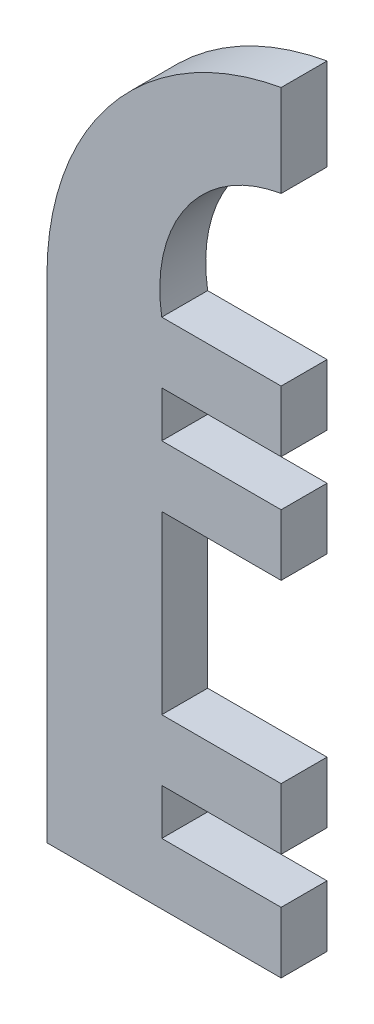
ISO-10303-21;
HEADER;
FILE_DESCRIPTION(('STEP AP214'),'2;1');
FILE_NAME('part.step','',(''),(''),'','','');
FILE_SCHEMA(('AUTOMOTIVE_DESIGN { 1 0 10303 214 1 1 1 1 }'));
ENDSEC;
DATA;
#1=APPLICATION_CONTEXT('core data for automotive mechanical design processes');
#2=APPLICATION_PROTOCOL_DEFINITION('international standard','automotive_design',2000,#1);
#3=PRODUCT_CONTEXT('',#1,'mechanical');
#4=PRODUCT('Part','Part','',(#3));
#5=PRODUCT_RELATED_PRODUCT_CATEGORY('part','',(#4));
#6=PRODUCT_DEFINITION_FORMATION('','',#4);
#7=PRODUCT_DEFINITION_CONTEXT('part definition',#1,'design');
#8=PRODUCT_DEFINITION('design','',#6,#7);
#9=PRODUCT_DEFINITION_SHAPE('','',#8);
#10=(LENGTH_UNIT() NAMED_UNIT(*) SI_UNIT(.MILLI.,.METRE.));
#11=(NAMED_UNIT(*) PLANE_ANGLE_UNIT() SI_UNIT($,.RADIAN.));
#12=(NAMED_UNIT(*) SI_UNIT($,.STERADIAN.) SOLID_ANGLE_UNIT());
#13=UNCERTAINTY_MEASURE_WITH_UNIT(LENGTH_MEASURE(1.E-05),#10,'distance_accuracy_value','');
#14=(GEOMETRIC_REPRESENTATION_CONTEXT(3) GLOBAL_UNCERTAINTY_ASSIGNED_CONTEXT((#13)) GLOBAL_UNIT_ASSIGNED_CONTEXT((#10,
#11,#12)) REPRESENTATION_CONTEXT('',''));
#15=CARTESIAN_POINT('',(0.,0.,0.));
#16=DIRECTION('',(0.,0.,1.));
#17=DIRECTION('',(1.,0.,0.));
#18=AXIS2_PLACEMENT_3D('',#15,#16,#17);
#19=CARTESIAN_POINT('',(0.,0.,3.));
#20=DIRECTION('',(0.,1.,0.));
#21=DIRECTION('',(-1.,0.,0.));
#22=AXIS2_PLACEMENT_3D('',#19,#20,#21);
#23=PLANE('',#22);
#24=DIRECTION('',(1.,0.,0.));
#25=VECTOR('',#24,1.);
#26=CARTESIAN_POINT('',(0.,0.,0.));
#27=LINE('',#26,#25);
#28=CARTESIAN_POINT('',(-15.3,0.,0.));
#29=VERTEX_POINT('',#28);
#30=CARTESIAN_POINT('',(0.,0.,0.));
#31=VERTEX_POINT('',#30);
#32=EDGE_CURVE('E210',#29,#31,#27,.T.);
#33=ORIENTED_EDGE('',*,*,#32,.T.);
#34=DIRECTION('',(0.,0.,-1.));
#35=VECTOR('',#34,1.);
#36=CARTESIAN_POINT('',(0.,0.,3.));
#37=LINE('',#36,#35);
#38=CARTESIAN_POINT('',(0.,0.,3.));
#39=VERTEX_POINT('',#38);
#40=EDGE_CURVE('E11',#39,#31,#37,.T.);
#41=ORIENTED_EDGE('',*,*,#40,.F.);
#42=DIRECTION('',(1.,0.,0.));
#43=VECTOR('',#42,1.);
#44=CARTESIAN_POINT('',(0.,0.,3.));
#45=LINE('',#44,#43);
#46=CARTESIAN_POINT('',(-15.3,0.,3.));
#47=VERTEX_POINT('',#46);
#48=EDGE_CURVE('E265',#47,#39,#45,.T.);
#49=ORIENTED_EDGE('',*,*,#48,.F.);
#50=DIRECTION('',(0.,0.,-1.));
#51=VECTOR('',#50,1.);
#52=CARTESIAN_POINT('',(-15.3,0.,3.));
#53=LINE('',#52,#51);
#54=EDGE_CURVE('E206',#47,#29,#53,.T.);
#55=ORIENTED_EDGE('',*,*,#54,.T.);
#56=EDGE_LOOP('',(#33,#41,#49,#55));
#57=FACE_BOUND('',#56,.T.);
#58=ADVANCED_FACE('F43',(#57),#23,.F.);
#59=CARTESIAN_POINT('',(0.,0.,3.));
#60=DIRECTION('',(-1.,0.,0.));
#61=DIRECTION('',(0.,0.,1.));
#62=AXIS2_PLACEMENT_3D('',#59,#60,#61);
#63=PLANE('',#62);
#64=DIRECTION('',(0.,1.,0.));
#65=VECTOR('',#64,1.);
#66=CARTESIAN_POINT('',(0.,0.,0.));
#67=LINE('',#66,#65);
#68=CARTESIAN_POINT('',(0.,4.,0.));
#69=VERTEX_POINT('',#68);
#70=EDGE_CURVE('E214',#31,#69,#67,.T.);
#71=ORIENTED_EDGE('',*,*,#70,.T.);
#72=DIRECTION('',(0.,0.,-1.));
#73=VECTOR('',#72,1.);
#74=CARTESIAN_POINT('',(0.,4.,3.));
#75=LINE('',#74,#73);
#76=CARTESIAN_POINT('',(0.,4.,3.));
#77=VERTEX_POINT('',#76);
#78=EDGE_CURVE('E52',#77,#69,#75,.T.);
#79=ORIENTED_EDGE('',*,*,#78,.F.);
#80=DIRECTION('',(0.,1.,0.));
#81=VECTOR('',#80,1.);
#82=CARTESIAN_POINT('',(0.,0.,3.));
#83=LINE('',#82,#81);
#84=EDGE_CURVE('E136',#39,#77,#83,.T.);
#85=ORIENTED_EDGE('',*,*,#84,.F.);
#86=ORIENTED_EDGE('',*,*,#40,.T.);
#87=EDGE_LOOP('',(#71,#79,#85,#86));
#88=FACE_BOUND('',#87,.T.);
#89=ADVANCED_FACE('F408',(#88),#63,.F.);
#90=CARTESIAN_POINT('',(-7.8,4.,3.));
#91=DIRECTION('',(0.,-1.,0.));
#92=DIRECTION('',(0.,0.,-1.));
#93=AXIS2_PLACEMENT_3D('',#90,#91,#92);
#94=PLANE('',#93);
#95=DIRECTION('',(-1.,0.,0.));
#96=VECTOR('',#95,1.);
#97=CARTESIAN_POINT('',(-7.8,4.,0.));
#98=LINE('',#97,#96);
#99=CARTESIAN_POINT('',(-7.8,4.,0.));
#100=VERTEX_POINT('',#99);
#101=EDGE_CURVE('E217',#69,#100,#98,.T.);
#102=ORIENTED_EDGE('',*,*,#101,.T.);
#103=DIRECTION('',(0.,0.,-1.));
#104=VECTOR('',#103,1.);
#105=CARTESIAN_POINT('',(-7.8,4.,3.));
#106=LINE('',#105,#104);
#107=CARTESIAN_POINT('',(-7.8,4.,3.));
#108=VERTEX_POINT('',#107);
#109=EDGE_CURVE('E320',#108,#100,#106,.T.);
#110=ORIENTED_EDGE('',*,*,#109,.F.);
#111=DIRECTION('',(-1.,0.,0.));
#112=VECTOR('',#111,1.);
#113=CARTESIAN_POINT('',(-7.8,4.,3.));
#114=LINE('',#113,#112);
#115=EDGE_CURVE('E330',#77,#108,#114,.T.);
#116=ORIENTED_EDGE('',*,*,#115,.F.);
#117=ORIENTED_EDGE('',*,*,#78,.T.);
#118=EDGE_LOOP('',(#102,#110,#116,#117));
#119=FACE_BOUND('',#118,.T.);
#120=ADVANCED_FACE('F328',(#119),#94,.F.);
#121=CARTESIAN_POINT('',(-7.8,7.,3.));
#122=DIRECTION('',(-1.,0.,0.));
#123=DIRECTION('',(0.,0.,1.));
#124=AXIS2_PLACEMENT_3D('',#121,#122,#123);
#125=PLANE('',#124);
#126=DIRECTION('',(0.,1.,0.));
#127=VECTOR('',#126,1.);
#128=CARTESIAN_POINT('',(-7.8,7.,0.));
#129=LINE('',#128,#127);
#130=CARTESIAN_POINT('',(-7.8,7.,0.));
#131=VERTEX_POINT('',#130);
#132=EDGE_CURVE('E220',#100,#131,#129,.T.);
#133=ORIENTED_EDGE('',*,*,#132,.T.);
#134=DIRECTION('',(0.,0.,-1.));
#135=VECTOR('',#134,1.);
#136=CARTESIAN_POINT('',(-7.8,7.,3.));
#137=LINE('',#136,#135);
#138=CARTESIAN_POINT('',(-7.8,7.,3.));
#139=VERTEX_POINT('',#138);
#140=EDGE_CURVE('E316',#139,#131,#137,.T.);
#141=ORIENTED_EDGE('',*,*,#140,.F.);
#142=DIRECTION('',(0.,1.,0.));
#143=VECTOR('',#142,1.);
#144=CARTESIAN_POINT('',(-7.8,7.,3.));
#145=LINE('',#144,#143);
#146=EDGE_CURVE('E349',#108,#139,#145,.T.);
#147=ORIENTED_EDGE('',*,*,#146,.F.);
#148=ORIENTED_EDGE('',*,*,#109,.T.);
#149=EDGE_LOOP('',(#133,#141,#147,#148));
#150=FACE_BOUND('',#149,.T.);
#151=ADVANCED_FACE('F339',(#150),#125,.F.);
#152=CARTESIAN_POINT('',(0.,7.,3.));
#153=DIRECTION('',(0.,1.,0.));
#154=DIRECTION('',(0.,0.,1.));
#155=AXIS2_PLACEMENT_3D('',#152,#153,#154);
#156=PLANE('',#155);
#157=DIRECTION('',(1.,0.,0.));
#158=VECTOR('',#157,1.);
#159=CARTESIAN_POINT('',(0.,7.,0.));
#160=LINE('',#159,#158);
#161=CARTESIAN_POINT('',(0.,7.,0.));
#162=VERTEX_POINT('',#161);
#163=EDGE_CURVE('E223',#131,#162,#160,.T.);
#164=ORIENTED_EDGE('',*,*,#163,.T.);
#165=DIRECTION('',(0.,0.,-1.));
#166=VECTOR('',#165,1.);
#167=CARTESIAN_POINT('',(0.,7.,3.));
#168=LINE('',#167,#166);
#169=CARTESIAN_POINT('',(0.,7.,3.));
#170=VERTEX_POINT('',#169);
#171=EDGE_CURVE('E312',#170,#162,#168,.T.);
#172=ORIENTED_EDGE('',*,*,#171,.F.);
#173=DIRECTION('',(1.,0.,0.));
#174=VECTOR('',#173,1.);
#175=CARTESIAN_POINT('',(0.,7.,3.));
#176=LINE('',#175,#174);
#177=EDGE_CURVE('E345',#139,#170,#176,.T.);
#178=ORIENTED_EDGE('',*,*,#177,.F.);
#179=ORIENTED_EDGE('',*,*,#140,.T.);
#180=EDGE_LOOP('',(#164,#172,#178,#179));
#181=FACE_BOUND('',#180,.T.);
#182=ADVANCED_FACE('F343',(#181),#156,.F.);
#183=CARTESIAN_POINT('',(0.,7.,3.));
#184=DIRECTION('',(-1.,0.,0.));
#185=DIRECTION('',(0.,0.,1.));
#186=AXIS2_PLACEMENT_3D('',#183,#184,#185);
#187=PLANE('',#186);
#188=DIRECTION('',(0.,1.,0.));
#189=VECTOR('',#188,1.);
#190=CARTESIAN_POINT('',(0.,7.,0.));
#191=LINE('',#190,#189);
#192=CARTESIAN_POINT('',(0.,11.,0.));
#193=VERTEX_POINT('',#192);
#194=EDGE_CURVE('E226',#162,#193,#191,.T.);
#195=ORIENTED_EDGE('',*,*,#194,.T.);
#196=DIRECTION('',(0.,0.,-1.));
#197=VECTOR('',#196,1.);
#198=CARTESIAN_POINT('',(0.,11.,3.));
#199=LINE('',#198,#197);
#200=CARTESIAN_POINT('',(0.,11.,3.));
#201=VERTEX_POINT('',#200);
#202=EDGE_CURVE('E308',#201,#193,#199,.T.);
#203=ORIENTED_EDGE('',*,*,#202,.F.);
#204=DIRECTION('',(0.,1.,0.));
#205=VECTOR('',#204,1.);
#206=CARTESIAN_POINT('',(0.,7.,3.));
#207=LINE('',#206,#205);
#208=EDGE_CURVE('E348',#170,#201,#207,.T.);
#209=ORIENTED_EDGE('',*,*,#208,.F.);
#210=ORIENTED_EDGE('',*,*,#171,.T.);
#211=EDGE_LOOP('',(#195,#203,#209,#210));
#212=FACE_BOUND('',#211,.T.);
#213=ADVANCED_FACE('F421',(#212),#187,.F.);
#214=CARTESIAN_POINT('',(0.,11.,3.));
#215=DIRECTION('',(0.,-1.,0.));
#216=DIRECTION('',(0.,0.,-1.));
#217=AXIS2_PLACEMENT_3D('',#214,#215,#216);
#218=PLANE('',#217);
#219=DIRECTION('',(-1.,0.,0.));
#220=VECTOR('',#219,1.);
#221=CARTESIAN_POINT('',(0.,11.,0.));
#222=LINE('',#221,#220);
#223=CARTESIAN_POINT('',(-7.8,11.,0.));
#224=VERTEX_POINT('',#223);
#225=EDGE_CURVE('E229',#193,#224,#222,.T.);
#226=ORIENTED_EDGE('',*,*,#225,.T.);
#227=DIRECTION('',(0.,0.,-1.));
#228=VECTOR('',#227,1.);
#229=CARTESIAN_POINT('',(-7.8,11.,3.));
#230=LINE('',#229,#228);
#231=CARTESIAN_POINT('',(-7.8,11.,3.));
#232=VERTEX_POINT('',#231);
#233=EDGE_CURVE('E304',#232,#224,#230,.T.);
#234=ORIENTED_EDGE('',*,*,#233,.F.);
#235=DIRECTION('',(-1.,0.,0.));
#236=VECTOR('',#235,1.);
#237=CARTESIAN_POINT('',(0.,11.,3.));
#238=LINE('',#237,#236);
#239=EDGE_CURVE('E353',#201,#232,#238,.T.);
#240=ORIENTED_EDGE('',*,*,#239,.F.);
#241=ORIENTED_EDGE('',*,*,#202,.T.);
#242=EDGE_LOOP('',(#226,#234,#240,#241));
#243=FACE_BOUND('',#242,.T.);
#244=ADVANCED_FACE('F424',(#243),#218,.F.);
#245=CARTESIAN_POINT('',(-7.8,11.,3.));
#246=DIRECTION('',(-1.,0.,0.));
#247=DIRECTION('',(0.,0.,1.));
#248=AXIS2_PLACEMENT_3D('',#245,#246,#247);
#249=PLANE('',#248);
#250=DIRECTION('',(0.,1.,0.));
#251=VECTOR('',#250,1.);
#252=CARTESIAN_POINT('',(-7.8,11.,0.));
#253=LINE('',#252,#251);
#254=CARTESIAN_POINT('',(-7.8,22.5,0.));
#255=VERTEX_POINT('',#254);
#256=EDGE_CURVE('E232',#224,#255,#253,.T.);
#257=ORIENTED_EDGE('',*,*,#256,.T.);
#258=DIRECTION('',(0.,0.,-1.));
#259=VECTOR('',#258,1.);
#260=CARTESIAN_POINT('',(-7.8,22.5,3.));
#261=LINE('',#260,#259);
#262=CARTESIAN_POINT('',(-7.8,22.5,3.));
#263=VERTEX_POINT('',#262);
#264=EDGE_CURVE('E300',#263,#255,#261,.T.);
#265=ORIENTED_EDGE('',*,*,#264,.F.);
#266=DIRECTION('',(0.,1.,0.));
#267=VECTOR('',#266,1.);
#268=CARTESIAN_POINT('',(-7.8,11.,3.));
#269=LINE('',#268,#267);
#270=EDGE_CURVE('E360',#232,#263,#269,.T.);
#271=ORIENTED_EDGE('',*,*,#270,.F.);
#272=ORIENTED_EDGE('',*,*,#233,.T.);
#273=EDGE_LOOP('',(#257,#265,#271,#272));
#274=FACE_BOUND('',#273,.T.);
#275=ADVANCED_FACE('F428',(#274),#249,.F.);
#276=CARTESIAN_POINT('',(-7.8,22.5,3.));
#277=DIRECTION('',(0.,1.,0.));
#278=DIRECTION('',(0.,0.,1.));
#279=AXIS2_PLACEMENT_3D('',#276,#277,#278);
#280=PLANE('',#279);
#281=DIRECTION('',(1.,0.,0.));
#282=VECTOR('',#281,1.);
#283=CARTESIAN_POINT('',(-7.8,22.5,0.));
#284=LINE('',#283,#282);
#285=CARTESIAN_POINT('',(0.,22.5,0.));
#286=VERTEX_POINT('',#285);
#287=EDGE_CURVE('E235',#255,#286,#284,.T.);
#288=ORIENTED_EDGE('',*,*,#287,.T.);
#289=DIRECTION('',(0.,0.,-1.));
#290=VECTOR('',#289,1.);
#291=CARTESIAN_POINT('',(0.,22.5,3.));
#292=LINE('',#291,#290);
#293=CARTESIAN_POINT('',(0.,22.5,3.));
#294=VERTEX_POINT('',#293);
#295=EDGE_CURVE('E296',#294,#286,#292,.T.);
#296=ORIENTED_EDGE('',*,*,#295,.F.);
#297=DIRECTION('',(1.,0.,0.));
#298=VECTOR('',#297,1.);
#299=CARTESIAN_POINT('',(-7.8,22.5,3.));
#300=LINE('',#299,#298);
#301=EDGE_CURVE('E363',#263,#294,#300,.T.);
#302=ORIENTED_EDGE('',*,*,#301,.F.);
#303=ORIENTED_EDGE('',*,*,#264,.T.);
#304=EDGE_LOOP('',(#288,#296,#302,#303));
#305=FACE_BOUND('',#304,.T.);
#306=ADVANCED_FACE('F432',(#305),#280,.F.);
#307=CARTESIAN_POINT('',(0.,22.5,3.));
#308=DIRECTION('',(-1.,0.,0.));
#309=DIRECTION('',(0.,0.,1.));
#310=AXIS2_PLACEMENT_3D('',#307,#308,#309);
#311=PLANE('',#310);
#312=DIRECTION('',(0.,1.,0.));
#313=VECTOR('',#312,1.);
#314=CARTESIAN_POINT('',(0.,22.5,0.));
#315=LINE('',#314,#313);
#316=CARTESIAN_POINT('',(0.,26.5,0.));
#317=VERTEX_POINT('',#316);
#318=EDGE_CURVE('E238',#286,#317,#315,.T.);
#319=ORIENTED_EDGE('',*,*,#318,.T.);
#320=DIRECTION('',(0.,0.,-1.));
#321=VECTOR('',#320,1.);
#322=CARTESIAN_POINT('',(0.,26.5,3.));
#323=LINE('',#322,#321);
#324=CARTESIAN_POINT('',(0.,26.5,3.));
#325=VERTEX_POINT('',#324);
#326=EDGE_CURVE('E292',#325,#317,#323,.T.);
#327=ORIENTED_EDGE('',*,*,#326,.F.);
#328=DIRECTION('',(0.,1.,0.));
#329=VECTOR('',#328,1.);
#330=CARTESIAN_POINT('',(0.,22.5,3.));
#331=LINE('',#330,#329);
#332=EDGE_CURVE('E366',#294,#325,#331,.T.);
#333=ORIENTED_EDGE('',*,*,#332,.F.);
#334=ORIENTED_EDGE('',*,*,#295,.T.);
#335=EDGE_LOOP('',(#319,#327,#333,#334));
#336=FACE_BOUND('',#335,.T.);
#337=ADVANCED_FACE('F436',(#336),#311,.F.);
#338=CARTESIAN_POINT('',(-7.8,26.5,3.));
#339=DIRECTION('',(0.,-1.,0.));
#340=DIRECTION('',(0.,0.,-1.));
#341=AXIS2_PLACEMENT_3D('',#338,#339,#340);
#342=PLANE('',#341);
#343=DIRECTION('',(-1.,0.,0.));
#344=VECTOR('',#343,1.);
#345=CARTESIAN_POINT('',(-7.8,26.5,0.));
#346=LINE('',#345,#344);
#347=CARTESIAN_POINT('',(-7.8,26.5,0.));
#348=VERTEX_POINT('',#347);
#349=EDGE_CURVE('E241',#317,#348,#346,.T.);
#350=ORIENTED_EDGE('',*,*,#349,.T.);
#351=DIRECTION('',(0.,0.,-1.));
#352=VECTOR('',#351,1.);
#353=CARTESIAN_POINT('',(-7.8,26.5,3.));
#354=LINE('',#353,#352);
#355=CARTESIAN_POINT('',(-7.8,26.5,3.));
#356=VERTEX_POINT('',#355);
#357=EDGE_CURVE('E288',#356,#348,#354,.T.);
#358=ORIENTED_EDGE('',*,*,#357,.F.);
#359=DIRECTION('',(-1.,0.,0.));
#360=VECTOR('',#359,1.);
#361=CARTESIAN_POINT('',(-7.8,26.5,3.));
#362=LINE('',#361,#360);
#363=EDGE_CURVE('E369',#325,#356,#362,.T.);
#364=ORIENTED_EDGE('',*,*,#363,.F.);
#365=ORIENTED_EDGE('',*,*,#326,.T.);
#366=EDGE_LOOP('',(#350,#358,#364,#365));
#367=FACE_BOUND('',#366,.T.);
#368=ADVANCED_FACE('F440',(#367),#342,.F.);
#369=CARTESIAN_POINT('',(-7.8,29.5,3.));
#370=DIRECTION('',(-1.,0.,0.));
#371=DIRECTION('',(0.,0.,1.));
#372=AXIS2_PLACEMENT_3D('',#369,#370,#371);
#373=PLANE('',#372);
#374=DIRECTION('',(0.,1.,0.));
#375=VECTOR('',#374,1.);
#376=CARTESIAN_POINT('',(-7.8,29.5,0.));
#377=LINE('',#376,#375);
#378=CARTESIAN_POINT('',(-7.8,29.5,0.));
#379=VERTEX_POINT('',#378);
#380=EDGE_CURVE('E244',#348,#379,#377,.T.);
#381=ORIENTED_EDGE('',*,*,#380,.T.);
#382=DIRECTION('',(0.,0.,-1.));
#383=VECTOR('',#382,1.);
#384=CARTESIAN_POINT('',(-7.8,29.5,3.));
#385=LINE('',#384,#383);
#386=CARTESIAN_POINT('',(-7.8,29.5,3.));
#387=VERTEX_POINT('',#386);
#388=EDGE_CURVE('E284',#387,#379,#385,.T.);
#389=ORIENTED_EDGE('',*,*,#388,.F.);
#390=DIRECTION('',(0.,1.,0.));
#391=VECTOR('',#390,1.);
#392=CARTESIAN_POINT('',(-7.8,29.5,3.));
#393=LINE('',#392,#391);
#394=EDGE_CURVE('E372',#356,#387,#393,.T.);
#395=ORIENTED_EDGE('',*,*,#394,.F.);
#396=ORIENTED_EDGE('',*,*,#357,.T.);
#397=EDGE_LOOP('',(#381,#389,#395,#396));
#398=FACE_BOUND('',#397,.T.);
#399=ADVANCED_FACE('F444',(#398),#373,.F.);
#400=CARTESIAN_POINT('',(0.,29.5,3.));
#401=DIRECTION('',(0.,1.,0.));
#402=DIRECTION('',(0.,0.,1.));
#403=AXIS2_PLACEMENT_3D('',#400,#401,#402);
#404=PLANE('',#403);
#405=DIRECTION('',(1.,0.,0.));
#406=VECTOR('',#405,1.);
#407=CARTESIAN_POINT('',(0.,29.5,0.));
#408=LINE('',#407,#406);
#409=CARTESIAN_POINT('',(0.,29.5,0.));
#410=VERTEX_POINT('',#409);
#411=EDGE_CURVE('E247',#379,#410,#408,.T.);
#412=ORIENTED_EDGE('',*,*,#411,.T.);
#413=DIRECTION('',(0.,0.,-1.));
#414=VECTOR('',#413,1.);
#415=CARTESIAN_POINT('',(0.,29.5,3.));
#416=LINE('',#415,#414);
#417=CARTESIAN_POINT('',(0.,29.5,3.));
#418=VERTEX_POINT('',#417);
#419=EDGE_CURVE('E280',#418,#410,#416,.T.);
#420=ORIENTED_EDGE('',*,*,#419,.F.);
#421=DIRECTION('',(1.,0.,0.));
#422=VECTOR('',#421,1.);
#423=CARTESIAN_POINT('',(0.,29.5,3.));
#424=LINE('',#423,#422);
#425=EDGE_CURVE('E375',#387,#418,#424,.T.);
#426=ORIENTED_EDGE('',*,*,#425,.F.);
#427=ORIENTED_EDGE('',*,*,#388,.T.);
#428=EDGE_LOOP('',(#412,#420,#426,#427));
#429=FACE_BOUND('',#428,.T.);
#430=ADVANCED_FACE('F448',(#429),#404,.F.);
#431=CARTESIAN_POINT('',(0.,29.5,3.));
#432=DIRECTION('',(-1.,0.,0.));
#433=DIRECTION('',(0.,0.,1.));
#434=AXIS2_PLACEMENT_3D('',#431,#432,#433);
#435=PLANE('',#434);
#436=DIRECTION('',(0.,1.,0.));
#437=VECTOR('',#436,1.);
#438=CARTESIAN_POINT('',(0.,29.5,0.));
#439=LINE('',#438,#437);
#440=CARTESIAN_POINT('',(0.,33.5,0.));
#441=VERTEX_POINT('',#440);
#442=EDGE_CURVE('E250',#410,#441,#439,.T.);
#443=ORIENTED_EDGE('',*,*,#442,.T.);
#444=DIRECTION('',(0.,0.,-1.));
#445=VECTOR('',#444,1.);
#446=CARTESIAN_POINT('',(0.,33.5,3.));
#447=LINE('',#446,#445);
#448=CARTESIAN_POINT('',(0.,33.5,3.));
#449=VERTEX_POINT('',#448);
#450=EDGE_CURVE('E276',#449,#441,#447,.T.);
#451=ORIENTED_EDGE('',*,*,#450,.F.);
#452=DIRECTION('',(0.,1.,0.));
#453=VECTOR('',#452,1.);
#454=CARTESIAN_POINT('',(0.,29.5,3.));
#455=LINE('',#454,#453);
#456=EDGE_CURVE('E378',#418,#449,#455,.T.);
#457=ORIENTED_EDGE('',*,*,#456,.F.);
#458=ORIENTED_EDGE('',*,*,#419,.T.);
#459=EDGE_LOOP('',(#443,#451,#457,#458));
#460=FACE_BOUND('',#459,.T.);
#461=ADVANCED_FACE('F452',(#460),#435,.F.);
#462=CARTESIAN_POINT('',(0.,33.5,3.));
#463=DIRECTION('',(0.,-1.,0.));
#464=DIRECTION('',(0.,0.,-1.));
#465=AXIS2_PLACEMENT_3D('',#462,#463,#464);
#466=PLANE('',#465);
#467=DIRECTION('',(-1.,0.,0.));
#468=VECTOR('',#467,1.);
#469=CARTESIAN_POINT('',(0.,33.5,0.));
#470=LINE('',#469,#468);
#471=CARTESIAN_POINT('',(-7.8,33.5,0.));
#472=VERTEX_POINT('',#471);
#473=EDGE_CURVE('E253',#441,#472,#470,.T.);
#474=ORIENTED_EDGE('',*,*,#473,.T.);
#475=DIRECTION('',(0.,0.,-1.));
#476=VECTOR('',#475,1.);
#477=CARTESIAN_POINT('',(-7.8,33.5,3.));
#478=LINE('',#477,#476);
#479=CARTESIAN_POINT('',(-7.8,33.5,3.));
#480=VERTEX_POINT('',#479);
#481=EDGE_CURVE('E272',#480,#472,#478,.T.);
#482=ORIENTED_EDGE('',*,*,#481,.F.);
#483=DIRECTION('',(-1.,0.,0.));
#484=VECTOR('',#483,1.);
#485=CARTESIAN_POINT('',(0.,33.5,3.));
#486=LINE('',#485,#484);
#487=EDGE_CURVE('E381',#449,#480,#486,.T.);
#488=ORIENTED_EDGE('',*,*,#487,.F.);
#489=ORIENTED_EDGE('',*,*,#450,.T.);
#490=EDGE_LOOP('',(#474,#482,#488,#489));
#491=FACE_BOUND('',#490,.T.);
#492=ADVANCED_FACE('F389',(#491),#466,.F.);
#493=CARTESIAN_POINT('',(1.54793538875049,35.0479353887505,3.));
#494=DIRECTION('',(0.,0.,-1.));
#495=DIRECTION('',(-1.,0.,0.));
#496=AXIS2_PLACEMENT_3D('',#493,#494,#495);
#497=CYLINDRICAL_SURFACE('',#496,9.47523086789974);
#498=CARTESIAN_POINT('',(1.54793538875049,35.0479353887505,0.));
#499=DIRECTION('',(0.,0.,-1.));
#500=DIRECTION('',(-1.,0.,0.));
#501=AXIS2_PLACEMENT_3D('',#498,#499,#500);
#502=CIRCLE('',#501,9.47523086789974);
#503=CARTESIAN_POINT('',(0.,44.395870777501,0.));
#504=VERTEX_POINT('',#503);
#505=EDGE_CURVE('E256',#472,#504,#502,.T.);
#506=ORIENTED_EDGE('',*,*,#505,.T.);
#507=DIRECTION('',(0.,0.,-1.));
#508=VECTOR('',#507,1.);
#509=CARTESIAN_POINT('',(0.,44.395870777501,3.));
#510=LINE('',#509,#508);
#511=CARTESIAN_POINT('',(0.,44.395870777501,3.));
#512=VERTEX_POINT('',#511);
#513=EDGE_CURVE('E199',#512,#504,#510,.T.);
#514=ORIENTED_EDGE('',*,*,#513,.F.);
#515=CARTESIAN_POINT('',(1.54793538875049,35.0479353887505,3.));
#516=DIRECTION('',(0.,0.,-1.));
#517=DIRECTION('',(-1.,0.,0.));
#518=AXIS2_PLACEMENT_3D('',#515,#516,#517);
#519=CIRCLE('',#518,9.47523086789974);
#520=EDGE_CURVE('E188',#480,#512,#519,.T.);
#521=ORIENTED_EDGE('',*,*,#520,.F.);
#522=ORIENTED_EDGE('',*,*,#481,.T.);
#523=EDGE_LOOP('',(#506,#514,#521,#522));
#524=FACE_BOUND('',#523,.T.);
#525=ADVANCED_FACE('F393',(#524),#497,.F.);
#526=CARTESIAN_POINT('',(0.,44.395870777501,3.));
#527=DIRECTION('',(-1.,0.,0.));
#528=DIRECTION('',(0.,-1.,0.));
#529=AXIS2_PLACEMENT_3D('',#526,#527,#528);
#530=PLANE('',#529);
#531=DIRECTION('',(0.,1.,0.));
#532=VECTOR('',#531,1.);
#533=CARTESIAN_POINT('',(0.,44.395870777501,0.));
#534=LINE('',#533,#532);
#535=CARTESIAN_POINT('',(0.,50.395870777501,0.));
#536=VERTEX_POINT('',#535);
#537=EDGE_CURVE('E197',#504,#536,#534,.T.);
#538=ORIENTED_EDGE('',*,*,#537,.T.);
#539=DIRECTION('',(0.,0.,-1.));
#540=VECTOR('',#539,1.);
#541=CARTESIAN_POINT('',(0.,50.395870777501,3.));
#542=LINE('',#541,#540);
#543=CARTESIAN_POINT('',(0.,50.395870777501,3.));
#544=VERTEX_POINT('',#543);
#545=EDGE_CURVE('E194',#544,#536,#542,.T.);
#546=ORIENTED_EDGE('',*,*,#545,.F.);
#547=DIRECTION('',(0.,1.,0.));
#548=VECTOR('',#547,1.);
#549=CARTESIAN_POINT('',(0.,44.395870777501,3.));
#550=LINE('',#549,#548);
#551=EDGE_CURVE('E182',#512,#544,#550,.T.);
#552=ORIENTED_EDGE('',*,*,#551,.F.);
#553=ORIENTED_EDGE('',*,*,#513,.T.);
#554=EDGE_LOOP('',(#538,#546,#552,#553));
#555=FACE_BOUND('',#554,.T.);
#556=ADVANCED_FACE('F195',(#555),#530,.F.);
#557=CARTESIAN_POINT('',(3.24132570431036,32.1400616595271,3.));
#558=DIRECTION('',(0.,0.,-1.));
#559=DIRECTION('',(-1.,0.,0.));
#560=AXIS2_PLACEMENT_3D('',#557,#558,#559);
#561=CYLINDRICAL_SURFACE('',#560,18.5413257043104);
#562=CARTESIAN_POINT('',(3.24132570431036,32.1400616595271,0.));
#563=DIRECTION('',(0.,0.,1.));
#564=DIRECTION('',(-1.,0.,0.));
#565=AXIS2_PLACEMENT_3D('',#562,#563,#564);
#566=CIRCLE('',#565,18.5413257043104);
#567=CARTESIAN_POINT('',(-15.3,32.1400616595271,0.));
#568=VERTEX_POINT('',#567);
#569=EDGE_CURVE('E122',#536,#568,#566,.T.);
#570=ORIENTED_EDGE('',*,*,#569,.T.);
#571=DIRECTION('',(0.,0.,-1.));
#572=VECTOR('',#571,1.);
#573=CARTESIAN_POINT('',(-15.3,32.1400616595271,3.));
#574=LINE('',#573,#572);
#575=CARTESIAN_POINT('',(-15.3,32.1400616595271,3.));
#576=VERTEX_POINT('',#575);
#577=EDGE_CURVE('E200',#576,#568,#574,.T.);
#578=ORIENTED_EDGE('',*,*,#577,.F.);
#579=CARTESIAN_POINT('',(3.24132570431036,32.1400616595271,3.));
#580=DIRECTION('',(0.,0.,1.));
#581=DIRECTION('',(-1.,0.,0.));
#582=AXIS2_PLACEMENT_3D('',#579,#580,#581);
#583=CIRCLE('',#582,18.5413257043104);
#584=EDGE_CURVE('E186',#544,#576,#583,.T.);
#585=ORIENTED_EDGE('',*,*,#584,.F.);
#586=ORIENTED_EDGE('',*,*,#545,.T.);
#587=EDGE_LOOP('',(#570,#578,#585,#586));
#588=FACE_BOUND('',#587,.T.);
#589=ADVANCED_FACE('F202',(#588),#561,.T.);
#590=CARTESIAN_POINT('',(-15.3,0.,3.));
#591=DIRECTION('',(1.,0.,0.));
#592=DIRECTION('',(0.,0.,-1.));
#593=AXIS2_PLACEMENT_3D('',#590,#591,#592);
#594=PLANE('',#593);
#595=DIRECTION('',(0.,-1.,0.));
#596=VECTOR('',#595,1.);
#597=CARTESIAN_POINT('',(-15.3,0.,0.));
#598=LINE('',#597,#596);
#599=EDGE_CURVE('E128',#568,#29,#598,.T.);
#600=ORIENTED_EDGE('',*,*,#599,.T.);
#601=ORIENTED_EDGE('',*,*,#54,.F.);
#602=DIRECTION('',(0.,-1.,0.));
#603=VECTOR('',#602,1.);
#604=CARTESIAN_POINT('',(-15.3,0.,3.));
#605=LINE('',#604,#603);
#606=EDGE_CURVE('E60',#576,#47,#605,.T.);
#607=ORIENTED_EDGE('',*,*,#606,.F.);
#608=ORIENTED_EDGE('',*,*,#577,.T.);
#609=EDGE_LOOP('',(#600,#601,#607,#608));
#610=FACE_BOUND('',#609,.T.);
#611=ADVANCED_FACE('F397',(#610),#594,.F.);
#612=CARTESIAN_POINT('',(3.24132570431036,32.1400616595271,3.));
#613=DIRECTION('',(0.,0.,-1.));
#614=DIRECTION('',(-1.,0.,0.));
#615=AXIS2_PLACEMENT_3D('',#612,#613,#614);
#616=PLANE('',#615);
#617=ORIENTED_EDGE('',*,*,#48,.T.);
#618=ORIENTED_EDGE('',*,*,#84,.T.);
#619=ORIENTED_EDGE('',*,*,#115,.T.);
#620=ORIENTED_EDGE('',*,*,#146,.T.);
#621=ORIENTED_EDGE('',*,*,#177,.T.);
#622=ORIENTED_EDGE('',*,*,#208,.T.);
#623=ORIENTED_EDGE('',*,*,#239,.T.);
#624=ORIENTED_EDGE('',*,*,#270,.T.);
#625=ORIENTED_EDGE('',*,*,#301,.T.);
#626=ORIENTED_EDGE('',*,*,#332,.T.);
#627=ORIENTED_EDGE('',*,*,#363,.T.);
#628=ORIENTED_EDGE('',*,*,#394,.T.);
#629=ORIENTED_EDGE('',*,*,#425,.T.);
#630=ORIENTED_EDGE('',*,*,#456,.T.);
#631=ORIENTED_EDGE('',*,*,#487,.T.);
#632=ORIENTED_EDGE('',*,*,#520,.T.);
#633=ORIENTED_EDGE('',*,*,#551,.T.);
#634=ORIENTED_EDGE('',*,*,#584,.T.);
#635=ORIENTED_EDGE('',*,*,#606,.T.);
#636=EDGE_LOOP('',(#617,#618,#619,#620,#621,#622,#623,#624,#625,#626,#627,#628,#629,#630,#631,
#632,#633,#634,#635));
#637=FACE_BOUND('',#636,.T.);
#638=ADVANCED_FACE('F184',(#637),#616,.F.);
#639=CARTESIAN_POINT('',(3.24132570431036,32.1400616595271,0.));
#640=DIRECTION('',(0.,0.,-1.));
#641=DIRECTION('',(-1.,0.,0.));
#642=AXIS2_PLACEMENT_3D('',#639,#640,#641);
#643=PLANE('',#642);
#644=ORIENTED_EDGE('',*,*,#32,.F.);
#645=ORIENTED_EDGE('',*,*,#599,.F.);
#646=ORIENTED_EDGE('',*,*,#569,.F.);
#647=ORIENTED_EDGE('',*,*,#537,.F.);
#648=ORIENTED_EDGE('',*,*,#505,.F.);
#649=ORIENTED_EDGE('',*,*,#473,.F.);
#650=ORIENTED_EDGE('',*,*,#442,.F.);
#651=ORIENTED_EDGE('',*,*,#411,.F.);
#652=ORIENTED_EDGE('',*,*,#380,.F.);
#653=ORIENTED_EDGE('',*,*,#349,.F.);
#654=ORIENTED_EDGE('',*,*,#318,.F.);
#655=ORIENTED_EDGE('',*,*,#287,.F.);
#656=ORIENTED_EDGE('',*,*,#256,.F.);
#657=ORIENTED_EDGE('',*,*,#225,.F.);
#658=ORIENTED_EDGE('',*,*,#194,.F.);
#659=ORIENTED_EDGE('',*,*,#163,.F.);
#660=ORIENTED_EDGE('',*,*,#132,.F.);
#661=ORIENTED_EDGE('',*,*,#101,.F.);
#662=ORIENTED_EDGE('',*,*,#70,.F.);
#663=EDGE_LOOP('',(#644,#645,#646,#647,#648,#649,#650,#651,#652,#653,#654,#655,#656,#657,#658,
#659,#660,#661,#662));
#664=FACE_BOUND('',#663,.T.);
#665=ADVANCED_FACE('F334',(#664),#643,.T.);
#666=CLOSED_SHELL('',(#58,#89,#120,#151,#182,#213,#244,#275,#306,#337,#368,#399,#430,#461,#492,
#525,#556,#589,#611,#638,#665));
#667=MANIFOLD_SOLID_BREP('B2',#666);
#668=ADVANCED_BREP_SHAPE_REPRESENTATION('',(#18,#667),#14);
#669=SHAPE_DEFINITION_REPRESENTATION(#9,#668);
ENDSEC;
END-ISO-10303-21;
